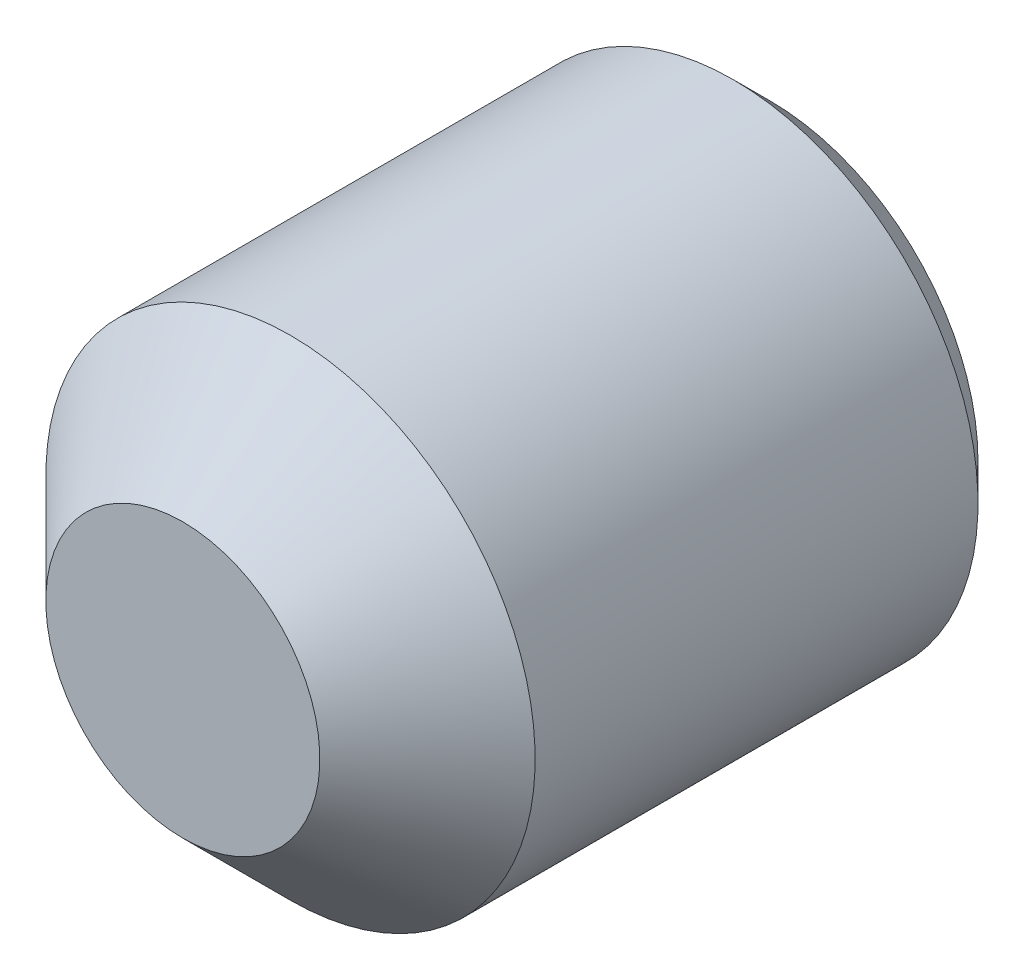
from build123d import *

# Parameters (mm, degrees)
CUT_EXTRUDE1_DEPTH = 4


with BuildPart() as part:
    # Sketch1 → Revolve1 (revolve)
    with BuildSketch(Plane(origin=(0, 0, 0), x_dir=(0, 0, -1), z_dir=(1, 0, 0)), mode=Mode.PRIVATE) as revolve1_sk:
        Polygon((-12, 0), (-5.502151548, 0), (-4, 2.5), (0, 2.5), (0, 4.24), (-10.545857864, 4.24), (-10.535857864, 4.25), (0, 4.25), (-0.75, 5), (-9.8, 5), (-12, 2.8), align=None)
    revolve(revolve1_sk.sketch.rotate(Axis((0, 0, 5.502151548), (0, 0, -1)), 180), axis=Axis((0, 0, 5.502151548), (0, 0, -1)))

    # Sketch2 → Cut-Extrude1 (cut)
    with BuildSketch(Plane(origin=(0, 0, 0), x_dir=(-1, 0, 0), z_dir=(0, 0, -1))):
        Polygon((1.443375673, -2.5), (2.886751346, 0), (1.443375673, 2.5), (-1.443375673, 2.5), (-2.886751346, 0), (-1.443375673, -2.5), align=None)
    extrude(amount=-CUT_EXTRUDE1_DEPTH, mode=Mode.SUBTRACT)


solid = part.part
